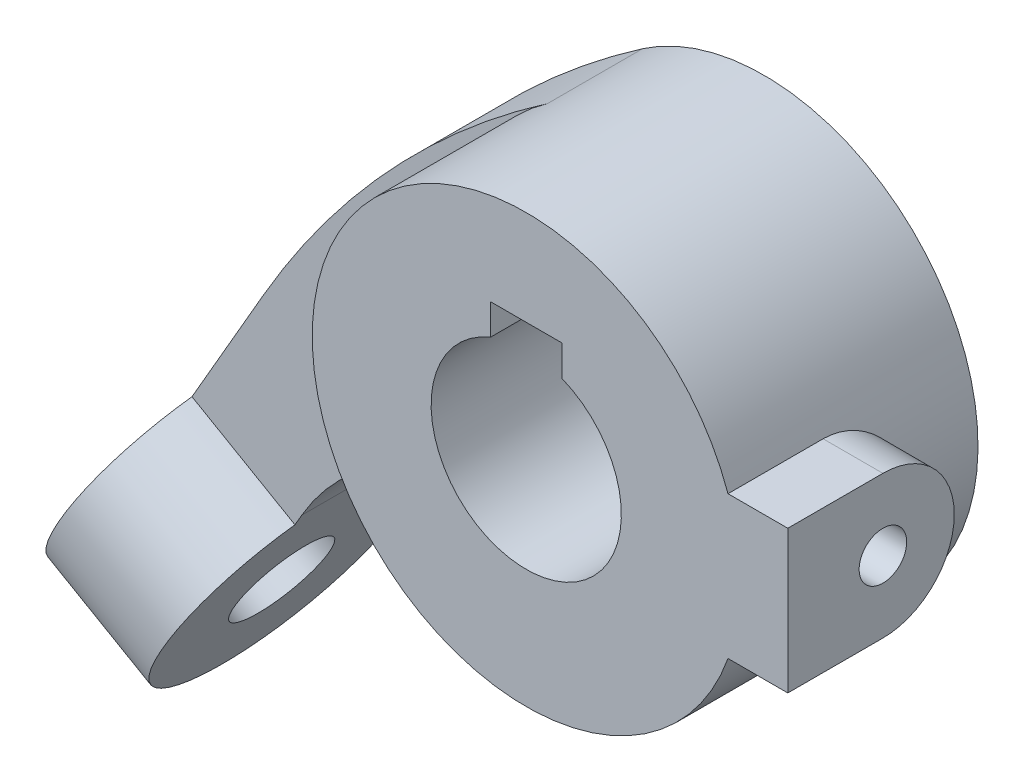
ISO-10303-21;
HEADER;
FILE_DESCRIPTION(('STEP AP214'),'2;1');
FILE_NAME('part.step','',(''),(''),'','','');
FILE_SCHEMA(('AUTOMOTIVE_DESIGN { 1 0 10303 214 1 1 1 1 }'));
ENDSEC;
DATA;
#1=APPLICATION_CONTEXT('core data for automotive mechanical design processes');
#2=APPLICATION_PROTOCOL_DEFINITION('international standard','automotive_design',2000,#1);
#3=PRODUCT_CONTEXT('',#1,'mechanical');
#4=PRODUCT('Part','Part','',(#3));
#5=PRODUCT_RELATED_PRODUCT_CATEGORY('part','',(#4));
#6=PRODUCT_DEFINITION_FORMATION('','',#4);
#7=PRODUCT_DEFINITION_CONTEXT('part definition',#1,'design');
#8=PRODUCT_DEFINITION('design','',#6,#7);
#9=PRODUCT_DEFINITION_SHAPE('','',#8);
#10=(LENGTH_UNIT() NAMED_UNIT(*) SI_UNIT(.MILLI.,.METRE.));
#11=(NAMED_UNIT(*) PLANE_ANGLE_UNIT() SI_UNIT($,.RADIAN.));
#12=(NAMED_UNIT(*) SI_UNIT($,.STERADIAN.) SOLID_ANGLE_UNIT());
#13=UNCERTAINTY_MEASURE_WITH_UNIT(LENGTH_MEASURE(1.E-05),#10,'distance_accuracy_value','');
#14=(GEOMETRIC_REPRESENTATION_CONTEXT(3) GLOBAL_UNCERTAINTY_ASSIGNED_CONTEXT((#13)) GLOBAL_UNIT_ASSIGNED_CONTEXT((#10,
#11,#12)) REPRESENTATION_CONTEXT('',''));
#15=CARTESIAN_POINT('',(0.,0.,0.));
#16=DIRECTION('',(0.,0.,1.));
#17=DIRECTION('',(1.,0.,0.));
#18=AXIS2_PLACEMENT_3D('',#15,#16,#17);
#19=CARTESIAN_POINT('',(0.,0.,20.));
#20=DIRECTION('',(0.,0.,-1.));
#21=DIRECTION('',(-1.,0.,0.));
#22=AXIS2_PLACEMENT_3D('',#19,#20,#21);
#23=CYLINDRICAL_SURFACE('',#22,18.);
#24=CARTESIAN_POINT('',(18.,0.,6.));
#25=CARTESIAN_POINT('',(18.000001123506,-0.327379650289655,5.99999767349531));
#26=CARTESIAN_POINT('',(17.9909867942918,-0.654748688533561,6.02687929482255));
#27=CARTESIAN_POINT('',(17.9559119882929,-1.29985304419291,6.13337695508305));
#28=CARTESIAN_POINT('',(17.9298497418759,-1.61758735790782,6.2129984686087));
#29=CARTESIAN_POINT('',(17.8635207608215,-2.23398736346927,6.42190706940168));
#30=CARTESIAN_POINT('',(17.8232777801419,-2.53268396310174,6.55111113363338));
#31=CARTESIAN_POINT('',(17.7326582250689,-3.1042846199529,6.85527828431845));
#32=CARTESIAN_POINT('',(17.6822796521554,-3.37718357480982,7.03025039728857));
#33=CARTESIAN_POINT('',(17.6021139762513,-3.76616319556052,7.32626606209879));
#34=CARTESIAN_POINT('',(17.5741584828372,-3.89422941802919,7.43243752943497));
#35=CARTESIAN_POINT('',(17.5176437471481,-4.14103139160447,7.65495433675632));
#36=CARTESIAN_POINT('',(17.4890847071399,-4.25977020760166,7.77129630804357));
#37=CARTESIAN_POINT('',(17.4321038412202,-4.48726302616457,8.01350986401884));
#38=CARTESIAN_POINT('',(17.4036821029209,-4.59601129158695,8.13938684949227));
#39=CARTESIAN_POINT('',(17.3477712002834,-4.80273826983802,8.39981515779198));
#40=CARTESIAN_POINT('',(17.3202817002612,-4.90072088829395,8.53436330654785));
#41=CARTESIAN_POINT('',(17.2662087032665,-5.08800724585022,8.8154236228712));
#42=CARTESIAN_POINT('',(17.2396751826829,-5.17697354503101,8.96217055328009));
#43=CARTESIAN_POINT('',(17.1892116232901,-5.34214016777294,9.26303536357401));
#44=CARTESIAN_POINT('',(17.165280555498,-5.41834554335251,9.41715029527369));
#45=CARTESIAN_POINT('',(17.1207625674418,-5.55741169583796,9.73179280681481));
#46=CARTESIAN_POINT('',(17.1001762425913,-5.62027009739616,9.89232152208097));
#47=CARTESIAN_POINT('',(17.0630401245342,-5.73202691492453,10.2185458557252));
#48=CARTESIAN_POINT('',(17.0464884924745,-5.78093169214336,10.384239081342));
#49=CARTESIAN_POINT('',(17.0184510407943,-5.86294638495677,10.7140137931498));
#50=CARTESIAN_POINT('',(17.0068148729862,-5.89652807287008,10.8779651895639));
#51=CARTESIAN_POINT('',(16.9882200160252,-5.94988922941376,11.208295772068));
#52=CARTESIAN_POINT('',(16.981259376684,-5.96967445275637,11.3746739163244));
#53=CARTESIAN_POINT('',(16.972243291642,-5.99526000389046,11.7086235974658));
#54=CARTESIAN_POINT('',(16.9701875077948,-6.00106129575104,11.8761950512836));
#55=CARTESIAN_POINT('',(16.9710505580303,-5.99862030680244,12.2112202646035));
#56=CARTESIAN_POINT('',(16.9739692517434,-5.99037842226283,12.3786740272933));
#57=CARTESIAN_POINT('',(16.9844341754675,-5.96063984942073,12.7044792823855));
#58=CARTESIAN_POINT('',(16.9917616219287,-5.93976958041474,12.8628954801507));
#59=CARTESIAN_POINT('',(17.0106306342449,-5.88551353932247,13.1773689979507));
#60=CARTESIAN_POINT('',(17.0221736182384,-5.85212355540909,13.3334255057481));
#61=CARTESIAN_POINT('',(17.0491237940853,-5.77313741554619,13.6420252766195));
#62=CARTESIAN_POINT('',(17.0645299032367,-5.72754467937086,13.794569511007));
#63=CARTESIAN_POINT('',(17.0987666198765,-5.62451111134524,14.0952671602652));
#64=CARTESIAN_POINT('',(17.1175985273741,-5.56706578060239,14.2434188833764));
#65=CARTESIAN_POINT('',(17.1584737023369,-5.43978996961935,14.5366577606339));
#66=CARTESIAN_POINT('',(17.1805627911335,-5.36977902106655,14.6816601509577));
#67=CARTESIAN_POINT('',(17.2271173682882,-5.21849496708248,14.9653261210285));
#68=CARTESIAN_POINT('',(17.2515836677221,-5.13721801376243,15.1039875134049));
#69=CARTESIAN_POINT('',(17.3022308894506,-4.96396506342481,15.3741372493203));
#70=CARTESIAN_POINT('',(17.3284119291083,-4.87198833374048,15.5056251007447));
#71=CARTESIAN_POINT('',(17.3818071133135,-4.67791711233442,15.7606879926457));
#72=CARTESIAN_POINT('',(17.4090212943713,-4.57582226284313,15.8842627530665));
#73=CARTESIAN_POINT('',(17.4652307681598,-4.3565109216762,16.1290695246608));
#74=CARTESIAN_POINT('',(17.4942446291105,-4.23878222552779,16.2498389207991));
#75=CARTESIAN_POINT('',(17.5518457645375,-3.99356544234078,16.4810517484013));
#76=CARTESIAN_POINT('',(17.5804331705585,-3.8660804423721,16.5914984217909));
#77=CARTESIAN_POINT('',(17.6364264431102,-3.60203839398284,16.8014351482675));
#78=CARTESIAN_POINT('',(17.66383174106,-3.46547705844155,16.900919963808));
#79=CARTESIAN_POINT('',(17.716688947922,-3.18424141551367,17.0881362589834));
#80=CARTESIAN_POINT('',(17.7421416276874,-3.03957034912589,17.1758723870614));
#81=CARTESIAN_POINT('',(17.7906577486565,-2.74144779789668,17.3398221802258));
#82=CARTESIAN_POINT('',(17.8136936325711,-2.58792073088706,17.4159067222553));
#83=CARTESIAN_POINT('',(17.8564062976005,-2.27458592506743,17.5547828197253));
#84=CARTESIAN_POINT('',(17.8760844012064,-2.11478068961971,17.6175796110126));
#85=CARTESIAN_POINT('',(17.9115215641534,-1.78999322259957,17.7293468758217));
#86=CARTESIAN_POINT('',(17.9272809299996,-1.62501139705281,17.7783184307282));
#87=CARTESIAN_POINT('',(17.954416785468,-1.29111086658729,17.8619664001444));
#88=CARTESIAN_POINT('',(17.9657934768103,-1.12219234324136,17.8966434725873));
#89=CARTESIAN_POINT('',(17.9834311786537,-0.789168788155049,17.9501600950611));
#90=CARTESIAN_POINT('',(17.9898933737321,-0.62517443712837,17.9696235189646));
#91=CARTESIAN_POINT('',(17.9983200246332,-0.295964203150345,17.9949702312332));
#92=CARTESIAN_POINT('',(18.0002829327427,-0.130747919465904,18.0008488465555));
#93=CARTESIAN_POINT('',(17.9996513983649,0.199509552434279,17.9989541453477));
#94=CARTESIAN_POINT('',(17.9970593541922,0.364550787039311,17.9911880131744));
#95=CARTESIAN_POINT('',(17.9873931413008,0.693361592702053,17.9620885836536));
#96=CARTESIAN_POINT('',(17.9803173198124,0.857130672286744,17.9407502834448));
#97=CARTESIAN_POINT('',(17.9621501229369,1.17733651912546,17.885532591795));
#98=CARTESIAN_POINT('',(17.9511829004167,1.333847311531,17.8520402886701));
#99=CARTESIAN_POINT('',(17.9254899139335,1.64345814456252,17.7727458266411));
#100=CARTESIAN_POINT('',(17.910762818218,1.79655695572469,17.7269393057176));
#101=CARTESIAN_POINT('',(17.8779285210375,2.0982565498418,17.6234099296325));
#102=CARTESIAN_POINT('',(17.8598222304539,2.24685853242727,17.5656902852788));
#103=CARTESIAN_POINT('',(17.8206824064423,2.53870192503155,17.4387820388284));
#104=CARTESIAN_POINT('',(17.7996478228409,2.68194138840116,17.3695893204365));
#105=CARTESIAN_POINT('',(17.7317545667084,3.10955308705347,17.1416569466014));
#106=CARTESIAN_POINT('',(17.6809813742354,3.38410495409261,16.9652088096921));
#107=CARTESIAN_POINT('',(17.5743027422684,3.90046380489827,16.57077871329));
#108=CARTESIAN_POINT('',(17.5183957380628,4.14226074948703,16.3527840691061));
#109=CARTESIAN_POINT('',(17.4336826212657,4.48120075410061,15.9934553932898));
#110=CARTESIAN_POINT('',(17.4046627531,4.59235115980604,15.8651188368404));
#111=CARTESIAN_POINT('',(17.3475844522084,4.80346249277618,15.5993761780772));
#112=CARTESIAN_POINT('',(17.3195256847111,4.90342734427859,15.4619732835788));
#113=CARTESIAN_POINT('',(17.2651671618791,5.09152241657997,15.1788835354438));
#114=CARTESIAN_POINT('',(17.2388681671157,5.17964753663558,15.0331931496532));
#115=CARTESIAN_POINT('',(17.1888391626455,5.34332580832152,14.7345648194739));
#116=CARTESIAN_POINT('',(17.1651080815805,5.41888421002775,14.5816299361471));
#117=CARTESIAN_POINT('',(17.1209765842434,5.5567432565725,14.2697205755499));
#118=CARTESIAN_POINT('',(17.1005710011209,5.61906451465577,14.1107559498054));
#119=CARTESIAN_POINT('',(17.0637127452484,5.73001985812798,13.78774169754));
#120=CARTESIAN_POINT('',(17.047258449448,5.77865956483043,13.6236941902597));
#121=CARTESIAN_POINT('',(17.0188467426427,5.86180765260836,13.291699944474));
#122=CARTESIAN_POINT('',(17.0068885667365,5.89631843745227,13.1237538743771));
#123=CARTESIAN_POINT('',(16.9878803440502,5.95086210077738,12.7852545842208));
#124=CARTESIAN_POINT('',(16.980830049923,5.97089570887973,12.6147014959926));
#125=CARTESIAN_POINT('',(16.9721165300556,5.99561670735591,12.2812106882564));
#126=CARTESIAN_POINT('',(16.9701941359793,6.00104252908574,12.1183340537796));
#127=CARTESIAN_POINT('',(16.971048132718,5.9986271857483,11.7926337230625));
#128=CARTESIAN_POINT('',(16.9738261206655,5.99078151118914,11.6298100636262));
#129=CARTESIAN_POINT('',(16.9839924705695,5.96189837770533,11.3055569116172));
#130=CARTESIAN_POINT('',(16.9913788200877,5.94086667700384,11.1441268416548));
#131=CARTESIAN_POINT('',(17.010528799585,5.88580987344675,10.8237014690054));
#132=CARTESIAN_POINT('',(17.02229407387,5.85177988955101,10.6647071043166));
#133=CARTESIAN_POINT('',(17.0495675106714,5.771827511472,10.3533873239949));
#134=CARTESIAN_POINT('',(17.0649985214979,5.72614898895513,10.2009923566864));
#135=CARTESIAN_POINT('',(17.0992751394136,5.62296574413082,9.90059838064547));
#136=CARTESIAN_POINT('',(17.1181219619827,5.56545681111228,9.75260095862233));
#137=CARTESIAN_POINT('',(17.1586949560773,5.43907961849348,9.46198600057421));
#138=CARTESIAN_POINT('',(17.1804205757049,5.37021353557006,9.31936744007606));
#139=CARTESIAN_POINT('',(17.2261759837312,5.2215810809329,9.04025253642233));
#140=CARTESIAN_POINT('',(17.2502066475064,5.1418105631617,8.90375854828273));
#141=CARTESIAN_POINT('',(17.3010197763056,4.96822239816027,8.63193335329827));
#142=CARTESIAN_POINT('',(17.3278763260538,4.87394621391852,8.49690814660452));
#143=CARTESIAN_POINT('',(17.3826786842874,4.67473803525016,8.23517405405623));
#144=CARTESIAN_POINT('',(17.4106248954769,4.56980207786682,8.1084682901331));
#145=CARTESIAN_POINT('',(17.4949712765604,4.23997033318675,7.74200919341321));
#146=CARTESIAN_POINT('',(17.5519192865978,3.99991932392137,7.51570892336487));
#147=CARTESIAN_POINT('',(17.6634103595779,3.47541732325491,7.09709157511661));
#148=CARTESIAN_POINT('',(17.7177731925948,3.18960052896,6.90644267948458));
#149=CARTESIAN_POINT('',(17.815557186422,2.5881526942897,6.57606865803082));
#150=CARTESIAN_POINT('',(17.8589811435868,2.27252930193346,6.43633051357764));
#151=CARTESIAN_POINT('',(17.9283314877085,1.63495978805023,6.2176673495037));
#152=CARTESIAN_POINT('',(17.9549529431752,1.31392615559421,6.13630428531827));
#153=CARTESIAN_POINT('',(17.9907842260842,0.661922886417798,6.02747923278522));
#154=CARTESIAN_POINT('',(17.9999988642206,0.33095602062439,6.00000235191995));
#155=CARTESIAN_POINT('',(18.,0.,6.));
#156=B_SPLINE_CURVE_WITH_KNOTS('',3,(#24,#25,#26,#27,#28,#29,#30,#31,#32,#33,#34,#35,#36,#37,
#38,#39,#40,#41,#42,#43,#44,#45,#46,#47,#48,#49,#50,#51,#52,#53,#54,#55,#56,#57,#58,#59,#60,#61,
#62,#63,#64,#65,#66,#67,#68,#69,#70,#71,#72,#73,#74,#75,#76,#77,#78,#79,#80,#81,#82,#83,#84,#85,
#86,#87,#88,#89,#90,#91,#92,#93,#94,#95,#96,#97,#98,#99,#100,#101,#102,#103,#104,#105,#106,#107,
#108,#109,#110,#111,#112,#113,#114,#115,#116,#117,#118,#119,#120,#121,#122,#123,#124,#125,#126,
#127,#128,#129,#130,#131,#132,#133,#134,#135,#136,#137,#138,#139,#140,#141,#142,#143,#144,#145,
#146,#147,#148,#149,#150,#151,#152,#153,#154,#155),.UNSPECIFIED.,.T.,.F.,(4,2,2,2,2,2,2,2,2,2,2,
2,2,2,2,2,2,2,2,2,2,2,2,2,2,2,2,2,2,2,2,2,2,2,2,2,2,2,2,2,2,2,2,2,2,2,2,2,2,2,2,2,2,2,2,2,2,2,2,
2,2,2,2,2,2,4),(0.,0.980922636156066,1.96194711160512,2.94133603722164,3.9209182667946,
4.42650795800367,4.93193081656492,5.43764212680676,5.94316936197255,6.46347458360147,
6.9835733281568,7.50376455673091,8.02371825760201,8.52635611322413,9.02878418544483,
9.53117761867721,10.0335568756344,10.5128532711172,10.9923110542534,11.4716346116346,
11.9511404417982,12.4381827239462,12.9253917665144,13.4126341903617,13.8998938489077,
14.4127033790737,14.9253513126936,15.4382431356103,15.9509314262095,16.4689439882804,
16.9867520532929,17.5045196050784,18.022263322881,18.517462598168,19.0128321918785,
19.5079410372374,20.003232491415,20.4839646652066,20.9648673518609,21.4456405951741,
21.9265867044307,22.9127919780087,23.8992988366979,24.4155088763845,24.931537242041,
25.4477872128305,25.9638209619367,26.4790451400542,26.9940573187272,27.5089818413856,
28.0238804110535,28.5122138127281,29.0007131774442,29.4889993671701,29.9774690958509,
30.4564495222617,30.9356007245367,31.4146602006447,31.8939023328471,32.3938860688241,
32.8940563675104,33.8936650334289,34.9322320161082,35.9705332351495,36.962445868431,
37.9540843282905),.UNSPECIFIED.);
#157=CARTESIAN_POINT('',(16.9705627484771,6.,12.));
#158=VERTEX_POINT('',#157);
#159=CARTESIAN_POINT('',(16.9705627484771,-6.,12.));
#160=VERTEX_POINT('',#159);
#161=EDGE_CURVE('E187',#158,#160,#156,.T.);
#162=ORIENTED_EDGE('',*,*,#161,.T.);
#163=DIRECTION('',(0.,0.,-1.));
#164=VECTOR('',#163,1.);
#165=CARTESIAN_POINT('',(16.9705627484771,-6.,20.));
#166=LINE('',#165,#164);
#167=CARTESIAN_POINT('',(16.9705627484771,-6.,20.));
#168=VERTEX_POINT('',#167);
#169=EDGE_CURVE('E184',#160,#168,#166,.F.);
#170=ORIENTED_EDGE('',*,*,#169,.T.);
#171=CARTESIAN_POINT('',(0.,0.,20.));
#172=DIRECTION('',(0.,0.,1.));
#173=DIRECTION('',(1.,0.,0.));
#174=AXIS2_PLACEMENT_3D('',#171,#172,#173);
#175=CIRCLE('',#174,18.);
#176=CARTESIAN_POINT('',(16.9705627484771,6.,20.));
#177=VERTEX_POINT('',#176);
#178=EDGE_CURVE('E39',#177,#168,#175,.T.);
#179=ORIENTED_EDGE('',*,*,#178,.F.);
#180=DIRECTION('',(0.,0.,-1.));
#181=VECTOR('',#180,1.);
#182=CARTESIAN_POINT('',(16.9705627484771,6.,20.));
#183=LINE('',#182,#181);
#184=EDGE_CURVE('E167',#177,#158,#183,.T.);
#185=ORIENTED_EDGE('',*,*,#184,.T.);
#186=EDGE_LOOP('',(#162,#170,#179,#185));
#187=FACE_BOUND('',#186,.T.);
#188=DIRECTION('',(0.,0.,-1.));
#189=VECTOR('',#188,1.);
#190=CARTESIAN_POINT('',(-10.2174061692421,14.819062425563,8.));
#191=LINE('',#190,#189);
#192=CARTESIAN_POINT('',(-10.2174061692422,14.819062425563,8.));
#193=VERTEX_POINT('',#192);
#194=CARTESIAN_POINT('',(-10.2174061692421,14.819062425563,0.));
#195=VERTEX_POINT('',#194);
#196=EDGE_CURVE('E280',#193,#195,#191,.T.);
#197=ORIENTED_EDGE('',*,*,#196,.F.);
#198=CARTESIAN_POINT('',(0.,0.,8.));
#199=DIRECTION('',(0.,0.,-1.));
#200=DIRECTION('',(1.,0.,0.));
#201=AXIS2_PLACEMENT_3D('',#198,#199,#200);
#202=CIRCLE('',#201,18.);
#203=CARTESIAN_POINT('',(-6.42576818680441,-16.8139675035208,8.));
#204=VERTEX_POINT('',#203);
#205=EDGE_CURVE('E146',#204,#193,#202,.T.);
#206=ORIENTED_EDGE('',*,*,#205,.F.);
#207=DIRECTION('',(0.,0.,-1.));
#208=VECTOR('',#207,1.);
#209=CARTESIAN_POINT('',(-6.42576818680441,-16.8139675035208,8.));
#210=LINE('',#209,#208);
#211=CARTESIAN_POINT('',(-6.42576818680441,-16.8139675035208,0.));
#212=VERTEX_POINT('',#211);
#213=EDGE_CURVE('E160',#204,#212,#210,.T.);
#214=ORIENTED_EDGE('',*,*,#213,.T.);
#215=CARTESIAN_POINT('',(0.,0.,0.));
#216=DIRECTION('',(0.,0.,1.));
#217=DIRECTION('',(1.,0.,0.));
#218=AXIS2_PLACEMENT_3D('',#215,#216,#217);
#219=CIRCLE('',#218,18.);
#220=EDGE_CURVE('E282',#212,#195,#219,.T.);
#221=ORIENTED_EDGE('',*,*,#220,.T.);
#222=EDGE_LOOP('',(#197,#206,#214,#221));
#223=FACE_BOUND('',#222,.T.);
#224=ADVANCED_FACE('F30',(#187,#223),#23,.T.);
#225=CARTESIAN_POINT('',(0.,0.,20.));
#226=DIRECTION('',(0.,0.,1.));
#227=DIRECTION('',(1.,0.,0.));
#228=AXIS2_PLACEMENT_3D('',#225,#226,#227);
#229=PLANE('',#228);
#230=ORIENTED_EDGE('',*,*,#178,.T.);
#231=DIRECTION('',(1.,0.,0.));
#232=VECTOR('',#231,1.);
#233=CARTESIAN_POINT('',(-18.001,-6.,20.));
#234=LINE('',#233,#232);
#235=CARTESIAN_POINT('',(22.,-6.,20.));
#236=VERTEX_POINT('',#235);
#237=EDGE_CURVE('E179',#168,#236,#234,.T.);
#238=ORIENTED_EDGE('',*,*,#237,.T.);
#239=DIRECTION('',(0.,-1.,0.));
#240=VECTOR('',#239,1.);
#241=CARTESIAN_POINT('',(22.,6.,20.));
#242=LINE('',#241,#240);
#243=CARTESIAN_POINT('',(22.,6.,20.));
#244=VERTEX_POINT('',#243);
#245=EDGE_CURVE('E168',#244,#236,#242,.T.);
#246=ORIENTED_EDGE('',*,*,#245,.F.);
#247=DIRECTION('',(1.,0.,0.));
#248=VECTOR('',#247,1.);
#249=CARTESIAN_POINT('',(-18.001,6.,20.));
#250=LINE('',#249,#248);
#251=EDGE_CURVE('E176',#177,#244,#250,.T.);
#252=ORIENTED_EDGE('',*,*,#251,.F.);
#253=EDGE_LOOP('',(#230,#238,#246,#252));
#254=FACE_BOUND('',#253,.T.);
#255=DIRECTION('',(0.,1.,0.));
#256=VECTOR('',#255,1.);
#257=CARTESIAN_POINT('',(3.,7.41619848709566,20.));
#258=LINE('',#257,#256);
#259=CARTESIAN_POINT('',(3.,7.41619848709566,20.));
#260=VERTEX_POINT('',#259);
#261=CARTESIAN_POINT('',(3.,10.,20.));
#262=VERTEX_POINT('',#261);
#263=EDGE_CURVE('E334',#260,#262,#258,.T.);
#264=ORIENTED_EDGE('',*,*,#263,.F.);
#265=CARTESIAN_POINT('',(0.,0.,20.));
#266=DIRECTION('',(0.,0.,1.));
#267=DIRECTION('',(1.,0.,0.));
#268=AXIS2_PLACEMENT_3D('',#265,#266,#267);
#269=CIRCLE('',#268,8.);
#270=CARTESIAN_POINT('',(-3.,7.41619848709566,20.));
#271=VERTEX_POINT('',#270);
#272=EDGE_CURVE('E194',#271,#260,#269,.T.);
#273=ORIENTED_EDGE('',*,*,#272,.F.);
#274=DIRECTION('',(0.,-1.,0.));
#275=VECTOR('',#274,1.);
#276=CARTESIAN_POINT('',(-3.,7.41619848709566,20.));
#277=LINE('',#276,#275);
#278=CARTESIAN_POINT('',(-3.,10.,20.));
#279=VERTEX_POINT('',#278);
#280=EDGE_CURVE('E319',#279,#271,#277,.T.);
#281=ORIENTED_EDGE('',*,*,#280,.F.);
#282=DIRECTION('',(-1.,0.,0.));
#283=VECTOR('',#282,1.);
#284=CARTESIAN_POINT('',(-3.,10.,20.));
#285=LINE('',#284,#283);
#286=EDGE_CURVE('E332',#262,#279,#285,.T.);
#287=ORIENTED_EDGE('',*,*,#286,.F.);
#288=EDGE_LOOP('',(#264,#273,#281,#287));
#289=FACE_BOUND('',#288,.T.);
#290=ADVANCED_FACE('F222',(#254,#289),#229,.T.);
#291=CARTESIAN_POINT('',(0.,0.,0.));
#292=DIRECTION('',(0.,0.,1.));
#293=DIRECTION('',(1.,0.,0.));
#294=AXIS2_PLACEMENT_3D('',#291,#292,#293);
#295=PLANE('',#294);
#296=DIRECTION('',(0.5,0.866025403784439,0.));
#297=VECTOR('',#296,1.);
#298=CARTESIAN_POINT('',(-30.8860186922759,-25.4961536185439,0.));
#299=LINE('',#298,#297);
#300=CARTESIAN_POINT('',(-31.6451254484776,-26.810965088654,0.));
#301=VERTEX_POINT('',#300);
#302=CARTESIAN_POINT('',(-30.8860186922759,-25.4961536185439,0.));
#303=VERTEX_POINT('',#302);
#304=EDGE_CURVE('E51',#301,#303,#299,.T.);
#305=ORIENTED_EDGE('',*,*,#304,.F.);
#306=DIRECTION('',(-0.866025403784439,0.5,0.));
#307=VECTOR('',#306,1.);
#308=CARTESIAN_POINT('',(-31.6451254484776,-26.810965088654,0.));
#309=LINE('',#308,#307);
#310=CARTESIAN_POINT('',(-40.305379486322,-21.810965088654,0.));
#311=VERTEX_POINT('',#310);
#312=EDGE_CURVE('E46',#301,#311,#309,.T.);
#313=ORIENTED_EDGE('',*,*,#312,.T.);
#314=DIRECTION('',(-0.5,-0.866025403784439,0.));
#315=VECTOR('',#314,1.);
#316=CARTESIAN_POINT('',(-34.0887443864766,-11.0434372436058,0.));
#317=LINE('',#316,#315);
#318=CARTESIAN_POINT('',(-34.0887443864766,-11.0434372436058,0.));
#319=VERTEX_POINT('',#318);
#320=EDGE_CURVE('E290',#319,#311,#317,.T.);
#321=ORIENTED_EDGE('',*,*,#320,.F.);
#322=CARTESIAN_POINT('',(35.1932879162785,-51.0434372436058,0.));
#323=DIRECTION('',(0.,0.,1.));
#324=DIRECTION('',(1.,0.,0.));
#325=AXIS2_PLACEMENT_3D('',#322,#323,#324);
#326=CIRCLE('',#325,80.);
#327=EDGE_CURVE('E153',#195,#319,#326,.T.);
#328=ORIENTED_EDGE('',*,*,#327,.F.);
#329=ORIENTED_EDGE('',*,*,#220,.F.);
#330=CARTESIAN_POINT('',(-13.5655106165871,-35.4961536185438,0.));
#331=DIRECTION('',(0.,0.,-1.));
#332=DIRECTION('',(1.,0.,0.));
#333=AXIS2_PLACEMENT_3D('',#330,#331,#332);
#334=CIRCLE('',#333,20.);
#335=EDGE_CURVE('E149',#303,#212,#334,.T.);
#336=ORIENTED_EDGE('',*,*,#335,.F.);
#337=EDGE_LOOP('',(#305,#313,#321,#328,#329,#336));
#338=FACE_BOUND('',#337,.T.);
#339=CARTESIAN_POINT('',(0.,0.,0.));
#340=DIRECTION('',(0.,0.,1.));
#341=DIRECTION('',(1.,0.,0.));
#342=AXIS2_PLACEMENT_3D('',#339,#340,#341);
#343=CIRCLE('',#342,8.);
#344=CARTESIAN_POINT('',(-3.,7.41619848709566,0.));
#345=VERTEX_POINT('',#344);
#346=CARTESIAN_POINT('',(3.,7.41619848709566,0.));
#347=VERTEX_POINT('',#346);
#348=EDGE_CURVE('E193',#345,#347,#343,.T.);
#349=ORIENTED_EDGE('',*,*,#348,.T.);
#350=DIRECTION('',(0.,1.,0.));
#351=VECTOR('',#350,1.);
#352=CARTESIAN_POINT('',(3.,7.41619848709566,0.));
#353=LINE('',#352,#351);
#354=CARTESIAN_POINT('',(3.,10.,0.));
#355=VERTEX_POINT('',#354);
#356=EDGE_CURVE('E326',#347,#355,#353,.T.);
#357=ORIENTED_EDGE('',*,*,#356,.T.);
#358=DIRECTION('',(-1.,0.,0.));
#359=VECTOR('',#358,1.);
#360=CARTESIAN_POINT('',(-3.,10.,0.));
#361=LINE('',#360,#359);
#362=CARTESIAN_POINT('',(-3.,10.,0.));
#363=VERTEX_POINT('',#362);
#364=EDGE_CURVE('E323',#355,#363,#361,.T.);
#365=ORIENTED_EDGE('',*,*,#364,.T.);
#366=DIRECTION('',(0.,-1.,0.));
#367=VECTOR('',#366,1.);
#368=CARTESIAN_POINT('',(-3.,7.41619848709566,0.));
#369=LINE('',#368,#367);
#370=EDGE_CURVE('E320',#363,#345,#369,.T.);
#371=ORIENTED_EDGE('',*,*,#370,.T.);
#372=EDGE_LOOP('',(#349,#357,#365,#371));
#373=FACE_BOUND('',#372,.T.);
#374=ADVANCED_FACE('F220',(#338,#373),#295,.F.);
#375=CARTESIAN_POINT('',(0.,0.,20.));
#376=DIRECTION('',(0.,0.,-1.));
#377=DIRECTION('',(-1.,0.,0.));
#378=AXIS2_PLACEMENT_3D('',#375,#376,#377);
#379=CYLINDRICAL_SURFACE('',#378,8.);
#380=CARTESIAN_POINT('',(8.,0.,10.));
#381=CARTESIAN_POINT('',(7.9999981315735,-0.110501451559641,10.0000031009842));
#382=CARTESIAN_POINT('',(7.99768770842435,-0.221037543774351,10.0091887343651));
#383=CARTESIAN_POINT('',(7.98869485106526,-0.438941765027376,10.045633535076));
#384=CARTESIAN_POINT('',(7.98200993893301,-0.546308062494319,10.0729029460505));
#385=CARTESIAN_POINT('',(7.96500835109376,-0.754694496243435,10.1445856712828));
#386=CARTESIAN_POINT('',(7.95469603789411,-0.855722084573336,10.188978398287));
#387=CARTESIAN_POINT('',(7.93153791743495,-1.04889617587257,10.2935751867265));
#388=CARTESIAN_POINT('',(7.91869202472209,-1.14104237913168,10.353779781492));
#389=CARTESIAN_POINT('',(7.89156551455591,-1.31573590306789,10.4896010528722));
#390=CARTESIAN_POINT('',(7.87726276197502,-1.39807425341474,10.5654820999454));
#391=CARTESIAN_POINT('',(7.84898160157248,-1.54899856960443,10.729936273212));
#392=CARTESIAN_POINT('',(7.83500323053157,-1.61758298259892,10.8185108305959));
#393=CARTESIAN_POINT('',(7.80873034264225,-1.74003539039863,11.007460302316));
#394=CARTESIAN_POINT('',(7.79646392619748,-1.79366962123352,11.1079909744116));
#395=CARTESIAN_POINT('',(7.77532659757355,-1.88319587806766,11.3169978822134));
#396=CARTESIAN_POINT('',(7.76645514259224,-1.91909074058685,11.4254728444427));
#397=CARTESIAN_POINT('',(7.7533396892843,-1.97140644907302,11.6449913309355));
#398=CARTESIAN_POINT('',(7.74900654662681,-1.98820302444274,11.755939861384));
#399=CARTESIAN_POINT('',(7.74519149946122,-2.00301570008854,11.9791580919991));
#400=CARTESIAN_POINT('',(7.74570880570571,-2.00103485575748,12.0914275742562));
#401=CARTESIAN_POINT('',(7.75145607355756,-1.97864869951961,12.3112210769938));
#402=CARTESIAN_POINT('',(7.75657150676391,-1.95869112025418,12.4187941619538));
#403=CARTESIAN_POINT('',(7.77075612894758,-1.90163224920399,12.6290147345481));
#404=CARTESIAN_POINT('',(7.77982559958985,-1.86452973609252,12.7316618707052));
#405=CARTESIAN_POINT('',(7.80100151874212,-1.77385263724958,12.9303173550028));
#406=CARTESIAN_POINT('',(7.81313769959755,-1.72011555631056,13.0262482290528));
#407=CARTESIAN_POINT('',(7.83906281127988,-1.59780836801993,13.2078916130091));
#408=CARTESIAN_POINT('',(7.85285203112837,-1.52923566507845,13.2936023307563));
#409=CARTESIAN_POINT('',(7.88101174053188,-1.37688456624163,13.4549381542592));
#410=CARTESIAN_POINT('',(7.89538759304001,-1.29272834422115,13.5302059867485));
#411=CARTESIAN_POINT('',(7.92274620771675,-1.11281589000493,13.6656283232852));
#412=CARTESIAN_POINT('',(7.93572892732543,-1.01705930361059,13.7257823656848));
#413=CARTESIAN_POINT('',(7.9589030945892,-0.816154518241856,13.8294007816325));
#414=CARTESIAN_POINT('',(7.96908480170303,-0.710975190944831,13.8728071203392));
#415=CARTESIAN_POINT('',(7.98543889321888,-0.49450134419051,13.9412230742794));
#416=CARTESIAN_POINT('',(7.99161204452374,-0.383207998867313,13.9662362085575));
#417=CARTESIAN_POINT('',(7.999139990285,-0.160719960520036,13.9966100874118));
#418=CARTESIAN_POINT('',(8.00061404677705,-0.0495956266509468,14.0024573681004));
#419=CARTESIAN_POINT('',(7.99891739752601,0.172043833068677,13.9956679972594));
#420=CARTESIAN_POINT('',(7.99574710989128,0.282559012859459,13.9830330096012));
#421=CARTESIAN_POINT('',(7.98519441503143,0.498152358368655,13.9400387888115));
#422=CARTESIAN_POINT('',(7.97787512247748,0.603286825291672,13.9099449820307));
#423=CARTESIAN_POINT('',(7.95984942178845,0.807009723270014,13.8331905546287));
#424=CARTESIAN_POINT('',(7.94914267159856,0.905597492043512,13.7865282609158));
#425=CARTESIAN_POINT('',(7.92524410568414,1.0953641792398,13.6770184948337));
#426=CARTESIAN_POINT('',(7.91201156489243,1.18638058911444,13.6138985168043));
#427=CARTESIAN_POINT('',(7.88459345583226,1.35670215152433,13.4736134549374));
#428=CARTESIAN_POINT('',(7.87040772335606,1.43600527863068,13.3964459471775));
#429=CARTESIAN_POINT('',(7.84225275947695,1.58265409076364,13.2279973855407));
#430=CARTESIAN_POINT('',(7.82829738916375,1.64965849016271,13.1364163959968));
#431=CARTESIAN_POINT('',(7.80257171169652,1.7673476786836,12.9430231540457));
#432=CARTESIAN_POINT('',(7.79080130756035,1.81803319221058,12.8412113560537));
#433=CARTESIAN_POINT('',(7.77090792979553,1.90126856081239,12.6307923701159));
#434=CARTESIAN_POINT('',(7.76276340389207,1.93392586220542,12.5222298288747));
#435=CARTESIAN_POINT('',(7.75102325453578,1.98046087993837,12.3009204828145));
#436=CARTESIAN_POINT('',(7.74742663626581,1.99434270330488,12.1881745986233));
#437=CARTESIAN_POINT('',(7.74526534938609,2.00271812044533,11.9651719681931));
#438=CARTESIAN_POINT('',(7.74655910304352,1.99775719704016,11.854936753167));
#439=CARTESIAN_POINT('',(7.7537054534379,1.96983637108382,11.6369281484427));
#440=CARTESIAN_POINT('',(7.75955795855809,1.94687683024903,11.5291547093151));
#441=CARTESIAN_POINT('',(7.77508347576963,1.88390842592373,11.3197220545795));
#442=CARTESIAN_POINT('',(7.78473353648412,1.84400187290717,11.2180302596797));
#443=CARTESIAN_POINT('',(7.80677007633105,1.74835321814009,11.0227128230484));
#444=CARTESIAN_POINT('',(7.81915693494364,1.69260892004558,10.9290883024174));
#445=CARTESIAN_POINT('',(7.84567512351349,1.56515699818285,10.7499271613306));
#446=CARTESIAN_POINT('',(7.85984353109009,1.49307088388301,10.6646652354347));
#447=CARTESIAN_POINT('',(7.88810702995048,1.33571916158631,10.5072706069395));
#448=CARTESIAN_POINT('',(7.90220210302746,1.25045042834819,10.435141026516));
#449=CARTESIAN_POINT('',(7.92903540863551,1.06729011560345,10.3047849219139));
#450=CARTESIAN_POINT('',(7.94174444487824,0.969197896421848,10.2468338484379));
#451=CARTESIAN_POINT('',(7.96406566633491,0.764354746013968,10.1483367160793));
#452=CARTESIAN_POINT('',(7.97368006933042,0.657610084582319,10.107778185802));
#453=CARTESIAN_POINT('',(7.98730746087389,0.459213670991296,10.0512375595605));
#454=CARTESIAN_POINT('',(7.9920344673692,0.368506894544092,10.0320650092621));
#455=CARTESIAN_POINT('',(7.99838140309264,0.185208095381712,10.0064454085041));
#456=CARTESIAN_POINT('',(8.00000156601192,0.0926162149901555,9.99999740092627));
#457=CARTESIAN_POINT('',(8.,0.,10.));
#458=B_SPLINE_CURVE_WITH_KNOTS('',3,(#380,#381,#382,#383,#384,#385,#386,#387,#388,#389,#390,
#391,#392,#393,#394,#395,#396,#397,#398,#399,#400,#401,#402,#403,#404,#405,#406,#407,#408,#409,
#410,#411,#412,#413,#414,#415,#416,#417,#418,#419,#420,#421,#422,#423,#424,#425,#426,#427,#428,
#429,#430,#431,#432,#433,#434,#435,#436,#437,#438,#439,#440,#441,#442,#443,#444,#445,#446,#447,
#448,#449,#450,#451,#452,#453,#454,#455,#456,#457),.UNSPECIFIED.,.T.,.F.,(4,2,2,2,2,2,2,2,2,2,2,
2,2,2,2,2,2,2,2,2,2,2,2,2,2,2,2,2,2,2,2,2,2,2,2,2,2,2,4),(0.,0.331164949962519,
0.662517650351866,0.993473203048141,1.32443992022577,1.66152580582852,1.99864972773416,
2.34078196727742,2.68285948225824,3.01808393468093,3.3532538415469,3.68029996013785,
4.00736937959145,4.337740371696,4.66816921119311,5.00802001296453,5.34788119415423,
5.68890972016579,6.02987298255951,6.36211078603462,6.69431868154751,7.02160366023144,
7.34892169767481,7.68204783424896,8.01523150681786,8.35659345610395,8.69794025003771,
9.03723006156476,9.37644564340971,9.70591707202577,10.0353818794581,10.3628853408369,
10.6904342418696,11.0265276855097,11.3627009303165,11.7049624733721,12.0469781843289,
12.3245632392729,12.6021274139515),.UNSPECIFIED.);
#459=CARTESIAN_POINT('',(8.,0.,10.));
#460=VERTEX_POINT('',#459);
#461=EDGE_CURVE('E224',#460,#460,#458,.T.);
#462=ORIENTED_EDGE('',*,*,#461,.F.);
#463=EDGE_LOOP('',(#462));
#464=FACE_BOUND('',#463,.T.);
#465=ORIENTED_EDGE('',*,*,#272,.T.);
#466=DIRECTION('',(0.,0.,-1.));
#467=VECTOR('',#466,1.);
#468=CARTESIAN_POINT('',(3.,7.41619848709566,20.));
#469=LINE('',#468,#467);
#470=EDGE_CURVE('E305',#260,#347,#469,.T.);
#471=ORIENTED_EDGE('',*,*,#470,.T.);
#472=ORIENTED_EDGE('',*,*,#348,.F.);
#473=DIRECTION('',(0.,0.,-1.));
#474=VECTOR('',#473,1.);
#475=CARTESIAN_POINT('',(-3.,7.41619848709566,20.));
#476=LINE('',#475,#474);
#477=EDGE_CURVE('E316',#271,#345,#476,.T.);
#478=ORIENTED_EDGE('',*,*,#477,.F.);
#479=EDGE_LOOP('',(#465,#471,#472,#478));
#480=FACE_BOUND('',#479,.T.);
#481=ADVANCED_FACE('F215',(#464,#480),#379,.F.);
#482=CARTESIAN_POINT('',(3.,7.41619848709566,20.));
#483=DIRECTION('',(-1.,0.,0.));
#484=DIRECTION('',(0.,0.,1.));
#485=AXIS2_PLACEMENT_3D('',#482,#483,#484);
#486=PLANE('',#485);
#487=ORIENTED_EDGE('',*,*,#356,.F.);
#488=ORIENTED_EDGE('',*,*,#470,.F.);
#489=ORIENTED_EDGE('',*,*,#263,.T.);
#490=DIRECTION('',(0.,0.,-1.));
#491=VECTOR('',#490,1.);
#492=CARTESIAN_POINT('',(3.,10.,20.));
#493=LINE('',#492,#491);
#494=EDGE_CURVE('E310',#262,#355,#493,.T.);
#495=ORIENTED_EDGE('',*,*,#494,.T.);
#496=EDGE_LOOP('',(#487,#488,#489,#495));
#497=FACE_BOUND('',#496,.T.);
#498=ADVANCED_FACE('F211',(#497),#486,.T.);
#499=CARTESIAN_POINT('',(-3.,10.,20.));
#500=DIRECTION('',(0.,-1.,0.));
#501=DIRECTION('',(0.,0.,-1.));
#502=AXIS2_PLACEMENT_3D('',#499,#500,#501);
#503=PLANE('',#502);
#504=ORIENTED_EDGE('',*,*,#364,.F.);
#505=ORIENTED_EDGE('',*,*,#494,.F.);
#506=ORIENTED_EDGE('',*,*,#286,.T.);
#507=DIRECTION('',(0.,0.,-1.));
#508=VECTOR('',#507,1.);
#509=CARTESIAN_POINT('',(-3.,10.,20.));
#510=LINE('',#509,#508);
#511=EDGE_CURVE('E314',#279,#363,#510,.T.);
#512=ORIENTED_EDGE('',*,*,#511,.T.);
#513=EDGE_LOOP('',(#504,#505,#506,#512));
#514=FACE_BOUND('',#513,.T.);
#515=ADVANCED_FACE('F207',(#514),#503,.T.);
#516=CARTESIAN_POINT('',(-3.,7.41619848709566,20.));
#517=DIRECTION('',(1.,0.,0.));
#518=DIRECTION('',(0.,1.,0.));
#519=AXIS2_PLACEMENT_3D('',#516,#517,#518);
#520=PLANE('',#519);
#521=ORIENTED_EDGE('',*,*,#370,.F.);
#522=ORIENTED_EDGE('',*,*,#511,.F.);
#523=ORIENTED_EDGE('',*,*,#280,.T.);
#524=ORIENTED_EDGE('',*,*,#477,.T.);
#525=EDGE_LOOP('',(#521,#522,#523,#524));
#526=FACE_BOUND('',#525,.T.);
#527=ADVANCED_FACE('F202',(#526),#520,.T.);
#528=CARTESIAN_POINT('',(-18.001,0.,12.));
#529=DIRECTION('',(1.,0.,0.));
#530=DIRECTION('',(0.,0.,-1.));
#531=AXIS2_PLACEMENT_3D('',#528,#529,#530);
#532=CYLINDRICAL_SURFACE('',#531,6.);
#533=ORIENTED_EDGE('',*,*,#161,.F.);
#534=DIRECTION('',(1.,0.,0.));
#535=VECTOR('',#534,1.);
#536=CARTESIAN_POINT('',(-18.001,6.,12.));
#537=LINE('',#536,#535);
#538=CARTESIAN_POINT('',(22.,6.,12.));
#539=VERTEX_POINT('',#538);
#540=EDGE_CURVE('E154',#158,#539,#537,.T.);
#541=ORIENTED_EDGE('',*,*,#540,.T.);
#542=CARTESIAN_POINT('',(22.,0.,12.));
#543=DIRECTION('',(1.,0.,0.));
#544=DIRECTION('',(0.,0.,-1.));
#545=AXIS2_PLACEMENT_3D('',#542,#543,#544);
#546=CIRCLE('',#545,6.);
#547=CARTESIAN_POINT('',(22.,-6.,12.));
#548=VERTEX_POINT('',#547);
#549=EDGE_CURVE('E174',#548,#539,#546,.T.);
#550=ORIENTED_EDGE('',*,*,#549,.F.);
#551=DIRECTION('',(1.,0.,0.));
#552=VECTOR('',#551,1.);
#553=CARTESIAN_POINT('',(-18.001,-6.,12.));
#554=LINE('',#553,#552);
#555=EDGE_CURVE('E157',#160,#548,#554,.T.);
#556=ORIENTED_EDGE('',*,*,#555,.F.);
#557=EDGE_LOOP('',(#533,#541,#550,#556));
#558=FACE_BOUND('',#557,.T.);
#559=ADVANCED_FACE('F196',(#558),#532,.T.);
#560=CARTESIAN_POINT('',(-18.001,-6.,12.));
#561=DIRECTION('',(0.,-1.,0.));
#562=DIRECTION('',(0.,0.,-1.));
#563=AXIS2_PLACEMENT_3D('',#560,#561,#562);
#564=PLANE('',#563);
#565=ORIENTED_EDGE('',*,*,#169,.F.);
#566=ORIENTED_EDGE('',*,*,#555,.T.);
#567=DIRECTION('',(0.,0.,-1.));
#568=VECTOR('',#567,1.);
#569=CARTESIAN_POINT('',(22.,-6.,12.));
#570=LINE('',#569,#568);
#571=EDGE_CURVE('E164',#236,#548,#570,.T.);
#572=ORIENTED_EDGE('',*,*,#571,.F.);
#573=ORIENTED_EDGE('',*,*,#237,.F.);
#574=EDGE_LOOP('',(#565,#566,#572,#573));
#575=FACE_BOUND('',#574,.T.);
#576=ADVANCED_FACE('F201',(#575),#564,.T.);
#577=CARTESIAN_POINT('',(-18.001,6.,12.));
#578=DIRECTION('',(0.,1.,0.));
#579=DIRECTION('',(0.,0.,1.));
#580=AXIS2_PLACEMENT_3D('',#577,#578,#579);
#581=PLANE('',#580);
#582=ORIENTED_EDGE('',*,*,#184,.F.);
#583=ORIENTED_EDGE('',*,*,#251,.T.);
#584=DIRECTION('',(0.,0.,1.));
#585=VECTOR('',#584,1.);
#586=CARTESIAN_POINT('',(22.,6.,12.));
#587=LINE('',#586,#585);
#588=EDGE_CURVE('E171',#539,#244,#587,.T.);
#589=ORIENTED_EDGE('',*,*,#588,.F.);
#590=ORIENTED_EDGE('',*,*,#540,.F.);
#591=EDGE_LOOP('',(#582,#583,#589,#590));
#592=FACE_BOUND('',#591,.T.);
#593=ADVANCED_FACE('F264',(#592),#581,.T.);
#594=CARTESIAN_POINT('',(22.,0.,12.));
#595=DIRECTION('',(1.,0.,0.));
#596=DIRECTION('',(0.,0.,-1.));
#597=AXIS2_PLACEMENT_3D('',#594,#595,#596);
#598=PLANE('',#597);
#599=CARTESIAN_POINT('',(22.,0.,12.));
#600=DIRECTION('',(1.,0.,0.));
#601=DIRECTION('',(0.,0.,-1.));
#602=AXIS2_PLACEMENT_3D('',#599,#600,#601);
#603=CIRCLE('',#602,2.);
#604=CARTESIAN_POINT('',(22.,0.,10.));
#605=VERTEX_POINT('',#604);
#606=EDGE_CURVE('E232',#605,#605,#603,.T.);
#607=ORIENTED_EDGE('',*,*,#606,.F.);
#608=EDGE_LOOP('',(#607));
#609=FACE_BOUND('',#608,.T.);
#610=ORIENTED_EDGE('',*,*,#549,.T.);
#611=ORIENTED_EDGE('',*,*,#588,.T.);
#612=ORIENTED_EDGE('',*,*,#245,.T.);
#613=ORIENTED_EDGE('',*,*,#571,.T.);
#614=EDGE_LOOP('',(#610,#611,#612,#613));
#615=FACE_BOUND('',#614,.T.);
#616=ADVANCED_FACE('F262',(#609,#615),#598,.T.);
#617=CARTESIAN_POINT('',(35.1932879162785,-51.0434372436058,8.));
#618=DIRECTION('',(0.,0.,-1.));
#619=DIRECTION('',(-1.,0.,0.));
#620=AXIS2_PLACEMENT_3D('',#617,#618,#619);
#621=CYLINDRICAL_SURFACE('',#620,80.);
#622=ORIENTED_EDGE('',*,*,#327,.T.);
#623=DIRECTION('',(0.,0.,-1.));
#624=VECTOR('',#623,1.);
#625=CARTESIAN_POINT('',(-34.0887443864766,-11.0434372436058,8.));
#626=LINE('',#625,#624);
#627=CARTESIAN_POINT('',(-34.0887443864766,-11.0434372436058,8.));
#628=VERTEX_POINT('',#627);
#629=EDGE_CURVE('E134',#628,#319,#626,.T.);
#630=ORIENTED_EDGE('',*,*,#629,.F.);
#631=CARTESIAN_POINT('',(35.1932879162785,-51.0434372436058,8.));
#632=DIRECTION('',(0.,0.,1.));
#633=DIRECTION('',(1.,0.,0.));
#634=AXIS2_PLACEMENT_3D('',#631,#632,#633);
#635=CIRCLE('',#634,80.);
#636=EDGE_CURVE('E140',#193,#628,#635,.T.);
#637=ORIENTED_EDGE('',*,*,#636,.F.);
#638=ORIENTED_EDGE('',*,*,#196,.T.);
#639=EDGE_LOOP('',(#622,#630,#637,#638));
#640=FACE_BOUND('',#639,.T.);
#641=ADVANCED_FACE('F151',(#640),#621,.T.);
#642=CARTESIAN_POINT('',(-34.0887443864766,-11.0434372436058,8.));
#643=DIRECTION('',(0.866025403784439,-0.5,0.));
#644=DIRECTION('',(0.5,0.866025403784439,0.));
#645=AXIS2_PLACEMENT_3D('',#642,#643,#644);
#646=PLANE('',#645);
#647=CARTESIAN_POINT('',(-44.7846096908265,-29.5692193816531,4.4436456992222));
#648=DIRECTION('',(-0.866025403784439,0.5,0.));
#649=DIRECTION('',(-0.5,-0.866025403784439,0.));
#650=AXIS2_PLACEMENT_3D('',#647,#648,#649);
#651=CIRCLE('',#650,4.);
#652=CARTESIAN_POINT('',(-46.7846096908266,-33.0333209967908,4.4436456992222));
#653=VERTEX_POINT('',#652);
#654=EDGE_CURVE('E231',#653,#653,#651,.T.);
#655=ORIENTED_EDGE('',*,*,#654,.F.);
#656=EDGE_LOOP('',(#655));
#657=FACE_BOUND('',#656,.T.);
#658=ORIENTED_EDGE('',*,*,#320,.T.);
#659=CARTESIAN_POINT('',(-44.7846096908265,-29.5692193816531,4.4436456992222));
#660=DIRECTION('',(-0.866025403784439,0.5,0.));
#661=DIRECTION('',(-0.5,-0.866025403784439,0.));
#662=AXIS2_PLACEMENT_3D('',#659,#660,#661);
#663=CIRCLE('',#662,10.);
#664=CARTESIAN_POINT('',(-40.1114858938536,-21.4751315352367,8.));
#665=VERTEX_POINT('',#664);
#666=EDGE_CURVE('E137',#311,#665,#663,.T.);
#667=ORIENTED_EDGE('',*,*,#666,.T.);
#668=DIRECTION('',(-0.5,-0.866025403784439,0.));
#669=VECTOR('',#668,1.);
#670=CARTESIAN_POINT('',(-34.0887443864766,-11.0434372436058,8.));
#671=LINE('',#670,#669);
#672=EDGE_CURVE('E130',#628,#665,#671,.T.);
#673=ORIENTED_EDGE('',*,*,#672,.F.);
#674=ORIENTED_EDGE('',*,*,#629,.T.);
#675=EDGE_LOOP('',(#658,#667,#673,#674));
#676=FACE_BOUND('',#675,.T.);
#677=ADVANCED_FACE('F132',(#657,#676),#646,.F.);
#678=CARTESIAN_POINT('',(-30.8860186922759,-25.4961536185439,8.));
#679=DIRECTION('',(-0.866025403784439,0.5,0.));
#680=DIRECTION('',(-0.5,-0.866025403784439,0.));
#681=AXIS2_PLACEMENT_3D('',#678,#679,#680);
#682=PLANE('',#681);
#683=CARTESIAN_POINT('',(-36.1243556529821,-34.5692193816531,4.4436456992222));
#684=DIRECTION('',(-0.866025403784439,0.5,0.));
#685=DIRECTION('',(-0.5,-0.866025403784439,0.));
#686=AXIS2_PLACEMENT_3D('',#683,#684,#685);
#687=CIRCLE('',#686,4.);
#688=CARTESIAN_POINT('',(-38.1243556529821,-38.0333209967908,4.4436456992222));
#689=VERTEX_POINT('',#688);
#690=EDGE_CURVE('E34',#689,#689,#687,.T.);
#691=ORIENTED_EDGE('',*,*,#690,.T.);
#692=EDGE_LOOP('',(#691));
#693=FACE_BOUND('',#692,.T.);
#694=CARTESIAN_POINT('',(-36.1243556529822,-34.5692193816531,4.4436456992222));
#695=DIRECTION('',(-0.866025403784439,0.5,0.));
#696=DIRECTION('',(-0.5,-0.866025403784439,0.));
#697=AXIS2_PLACEMENT_3D('',#694,#695,#696);
#698=CIRCLE('',#697,10.);
#699=CARTESIAN_POINT('',(-31.4512318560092,-26.4751315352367,8.));
#700=VERTEX_POINT('',#699);
#701=EDGE_CURVE('E296',#301,#700,#698,.T.);
#702=ORIENTED_EDGE('',*,*,#701,.F.);
#703=ORIENTED_EDGE('',*,*,#304,.T.);
#704=DIRECTION('',(0.,0.,-1.));
#705=VECTOR('',#704,1.);
#706=CARTESIAN_POINT('',(-30.8860186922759,-25.4961536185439,8.));
#707=LINE('',#706,#705);
#708=CARTESIAN_POINT('',(-30.8860186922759,-25.4961536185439,8.));
#709=VERTEX_POINT('',#708);
#710=EDGE_CURVE('E155',#709,#303,#707,.T.);
#711=ORIENTED_EDGE('',*,*,#710,.F.);
#712=DIRECTION('',(0.5,0.866025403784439,0.));
#713=VECTOR('',#712,1.);
#714=CARTESIAN_POINT('',(-30.8860186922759,-25.4961536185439,8.));
#715=LINE('',#714,#713);
#716=EDGE_CURVE('E139',#700,#709,#715,.T.);
#717=ORIENTED_EDGE('',*,*,#716,.F.);
#718=EDGE_LOOP('',(#702,#703,#711,#717));
#719=FACE_BOUND('',#718,.T.);
#720=ADVANCED_FACE('F252',(#693,#719),#682,.F.);
#721=CARTESIAN_POINT('',(-13.5655106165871,-35.4961536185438,8.));
#722=DIRECTION('',(0.,0.,-1.));
#723=DIRECTION('',(-1.,0.,0.));
#724=AXIS2_PLACEMENT_3D('',#721,#722,#723);
#725=CYLINDRICAL_SURFACE('',#724,20.);
#726=ORIENTED_EDGE('',*,*,#335,.T.);
#727=ORIENTED_EDGE('',*,*,#213,.F.);
#728=CARTESIAN_POINT('',(-13.5655106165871,-35.4961536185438,8.));
#729=DIRECTION('',(0.,0.,-1.));
#730=DIRECTION('',(1.,0.,0.));
#731=AXIS2_PLACEMENT_3D('',#728,#729,#730);
#732=CIRCLE('',#731,20.);
#733=EDGE_CURVE('E284',#709,#204,#732,.T.);
#734=ORIENTED_EDGE('',*,*,#733,.F.);
#735=ORIENTED_EDGE('',*,*,#710,.T.);
#736=EDGE_LOOP('',(#726,#727,#734,#735));
#737=FACE_BOUND('',#736,.T.);
#738=ADVANCED_FACE('F249',(#737),#725,.F.);
#739=CARTESIAN_POINT('',(35.1932879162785,-51.0434372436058,8.));
#740=DIRECTION('',(0.,0.,1.));
#741=DIRECTION('',(1.,0.,0.));
#742=AXIS2_PLACEMENT_3D('',#739,#740,#741);
#743=PLANE('',#742);
#744=DIRECTION('',(-0.866025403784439,0.5,0.));
#745=VECTOR('',#744,1.);
#746=CARTESIAN_POINT('',(-31.4512318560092,-26.4751315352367,8.));
#747=LINE('',#746,#745);
#748=EDGE_CURVE('E11',#700,#665,#747,.T.);
#749=ORIENTED_EDGE('',*,*,#748,.F.);
#750=ORIENTED_EDGE('',*,*,#716,.T.);
#751=ORIENTED_EDGE('',*,*,#733,.T.);
#752=ORIENTED_EDGE('',*,*,#205,.T.);
#753=ORIENTED_EDGE('',*,*,#636,.T.);
#754=ORIENTED_EDGE('',*,*,#672,.T.);
#755=EDGE_LOOP('',(#749,#750,#751,#752,#753,#754));
#756=FACE_BOUND('',#755,.T.);
#757=ADVANCED_FACE('F144',(#756),#743,.T.);
#758=CARTESIAN_POINT('',(-36.1243556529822,-34.5692193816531,4.4436456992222));
#759=DIRECTION('',(-0.866025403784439,0.5,0.));
#760=DIRECTION('',(-0.5,-0.866025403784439,0.));
#761=AXIS2_PLACEMENT_3D('',#758,#759,#760);
#762=CYLINDRICAL_SURFACE('',#761,10.);
#763=ORIENTED_EDGE('',*,*,#312,.F.);
#764=ORIENTED_EDGE('',*,*,#701,.T.);
#765=ORIENTED_EDGE('',*,*,#748,.T.);
#766=ORIENTED_EDGE('',*,*,#666,.F.);
#767=EDGE_LOOP('',(#763,#764,#765,#766));
#768=FACE_BOUND('',#767,.T.);
#769=ADVANCED_FACE('F242',(#768),#762,.T.);
#770=CARTESIAN_POINT('',(-35.2583302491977,-35.0692193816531,4.4436456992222));
#771=DIRECTION('',(-0.866025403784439,0.5,0.));
#772=DIRECTION('',(-0.5,-0.866025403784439,0.));
#773=AXIS2_PLACEMENT_3D('',#770,#771,#772);
#774=CYLINDRICAL_SURFACE('',#773,4.);
#775=ORIENTED_EDGE('',*,*,#654,.T.);
#776=EDGE_LOOP('',(#775));
#777=FACE_BOUND('',#776,.T.);
#778=ORIENTED_EDGE('',*,*,#690,.F.);
#779=EDGE_LOOP('',(#778));
#780=FACE_BOUND('',#779,.T.);
#781=ADVANCED_FACE('F238',(#777,#780),#774,.F.);
#782=CARTESIAN_POINT('',(2.,0.,12.));
#783=DIRECTION('',(1.,0.,0.));
#784=DIRECTION('',(0.,0.,-1.));
#785=AXIS2_PLACEMENT_3D('',#782,#783,#784);
#786=CYLINDRICAL_SURFACE('',#785,2.);
#787=ORIENTED_EDGE('',*,*,#461,.T.);
#788=EDGE_LOOP('',(#787));
#789=FACE_BOUND('',#788,.T.);
#790=ORIENTED_EDGE('',*,*,#606,.T.);
#791=EDGE_LOOP('',(#790));
#792=FACE_BOUND('',#791,.T.);
#793=ADVANCED_FACE('F234',(#789,#792),#786,.F.);
#794=CLOSED_SHELL('',(#224,#290,#374,#481,#498,#515,#527,#559,#576,#593,#616,#641,#677,#720,
#738,#757,#769,#781,#793));
#795=MANIFOLD_SOLID_BREP('B2',#794);
#796=ADVANCED_BREP_SHAPE_REPRESENTATION('',(#18,#795),#14);
#797=SHAPE_DEFINITION_REPRESENTATION(#9,#796);
ENDSEC;
END-ISO-10303-21;
